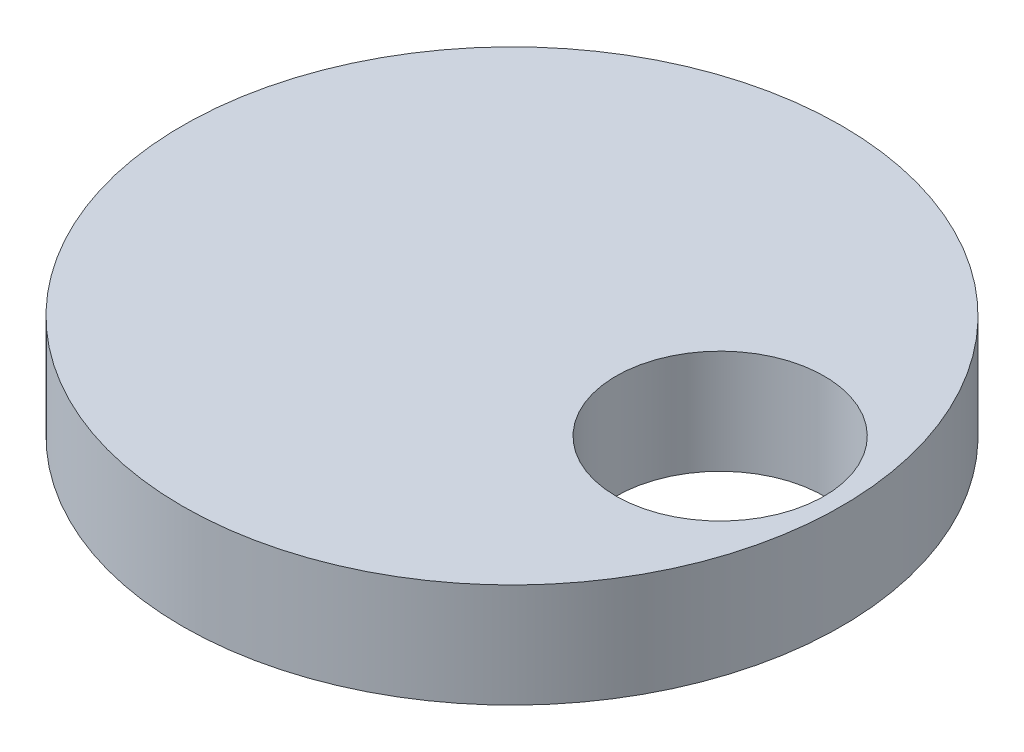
ISO-10303-21;
HEADER;
FILE_DESCRIPTION(('STEP AP214'),'2;1');
FILE_NAME('part.step','',(''),(''),'','','');
FILE_SCHEMA(('AUTOMOTIVE_DESIGN { 1 0 10303 214 1 1 1 1 }'));
ENDSEC;
DATA;
#1=APPLICATION_CONTEXT('core data for automotive mechanical design processes');
#2=APPLICATION_PROTOCOL_DEFINITION('international standard','automotive_design',2000,#1);
#3=PRODUCT_CONTEXT('',#1,'mechanical');
#4=PRODUCT('Part','Part','',(#3));
#5=PRODUCT_RELATED_PRODUCT_CATEGORY('part','',(#4));
#6=PRODUCT_DEFINITION_FORMATION('','',#4);
#7=PRODUCT_DEFINITION_CONTEXT('part definition',#1,'design');
#8=PRODUCT_DEFINITION('design','',#6,#7);
#9=PRODUCT_DEFINITION_SHAPE('','',#8);
#10=(LENGTH_UNIT() NAMED_UNIT(*) SI_UNIT(.MILLI.,.METRE.));
#11=(NAMED_UNIT(*) PLANE_ANGLE_UNIT() SI_UNIT($,.RADIAN.));
#12=(NAMED_UNIT(*) SI_UNIT($,.STERADIAN.) SOLID_ANGLE_UNIT());
#13=UNCERTAINTY_MEASURE_WITH_UNIT(LENGTH_MEASURE(1.E-05),#10,'distance_accuracy_value','');
#14=(GEOMETRIC_REPRESENTATION_CONTEXT(3) GLOBAL_UNCERTAINTY_ASSIGNED_CONTEXT((#13)) GLOBAL_UNIT_ASSIGNED_CONTEXT((#10,
#11,#12)) REPRESENTATION_CONTEXT('',''));
#15=CARTESIAN_POINT('',(0.,0.,0.));
#16=DIRECTION('',(0.,0.,1.));
#17=DIRECTION('',(1.,0.,0.));
#18=AXIS2_PLACEMENT_3D('',#15,#16,#17);
#19=CARTESIAN_POINT('',(0.,3.,0.));
#20=DIRECTION('',(0.,1.,0.));
#21=DIRECTION('',(0.,0.,1.));
#22=AXIS2_PLACEMENT_3D('',#19,#20,#21);
#23=PLANE('',#22);
#24=CARTESIAN_POINT('',(0.,3.,0.));
#25=DIRECTION('',(0.,1.,0.));
#26=DIRECTION('',(0.,0.,1.));
#27=AXIS2_PLACEMENT_3D('',#24,#25,#26);
#28=CIRCLE('',#27,9.5);
#29=CARTESIAN_POINT('',(0.,3.,9.5));
#30=VERTEX_POINT('',#29);
#31=EDGE_CURVE('E10',#30,#30,#28,.T.);
#32=ORIENTED_EDGE('',*,*,#31,.T.);
#33=EDGE_LOOP('',(#32));
#34=FACE_BOUND('',#33,.T.);
#35=CARTESIAN_POINT('',(6.,3.,0.));
#36=DIRECTION('',(0.,1.,0.));
#37=DIRECTION('',(0.,0.,1.));
#38=AXIS2_PLACEMENT_3D('',#35,#36,#37);
#39=CIRCLE('',#38,3.);
#40=CARTESIAN_POINT('',(6.,3.,3.));
#41=VERTEX_POINT('',#40);
#42=EDGE_CURVE('E43',#41,#41,#39,.T.);
#43=ORIENTED_EDGE('',*,*,#42,.F.);
#44=EDGE_LOOP('',(#43));
#45=FACE_BOUND('',#44,.T.);
#46=ADVANCED_FACE('F32',(#34,#45),#23,.T.);
#47=CARTESIAN_POINT('',(0.,0.,0.));
#48=DIRECTION('',(0.,1.,0.));
#49=DIRECTION('',(0.,0.,1.));
#50=AXIS2_PLACEMENT_3D('',#47,#48,#49);
#51=PLANE('',#50);
#52=CARTESIAN_POINT('',(0.,0.,0.));
#53=DIRECTION('',(0.,1.,0.));
#54=DIRECTION('',(0.,0.,1.));
#55=AXIS2_PLACEMENT_3D('',#52,#53,#54);
#56=CIRCLE('',#55,9.5);
#57=CARTESIAN_POINT('',(0.,0.,9.5));
#58=VERTEX_POINT('',#57);
#59=EDGE_CURVE('E39',#58,#58,#56,.T.);
#60=ORIENTED_EDGE('',*,*,#59,.F.);
#61=EDGE_LOOP('',(#60));
#62=FACE_BOUND('',#61,.T.);
#63=CARTESIAN_POINT('',(6.,0.,0.));
#64=DIRECTION('',(0.,1.,0.));
#65=DIRECTION('',(0.,0.,1.));
#66=AXIS2_PLACEMENT_3D('',#63,#64,#65);
#67=CIRCLE('',#66,3.);
#68=CARTESIAN_POINT('',(6.,0.,3.));
#69=VERTEX_POINT('',#68);
#70=EDGE_CURVE('E47',#69,#69,#67,.T.);
#71=ORIENTED_EDGE('',*,*,#70,.T.);
#72=EDGE_LOOP('',(#71));
#73=FACE_BOUND('',#72,.T.);
#74=ADVANCED_FACE('F53',(#62,#73),#51,.F.);
#75=CARTESIAN_POINT('',(0.,3.,0.));
#76=DIRECTION('',(0.,-1.,0.));
#77=DIRECTION('',(0.,0.,-1.));
#78=AXIS2_PLACEMENT_3D('',#75,#76,#77);
#79=CYLINDRICAL_SURFACE('',#78,9.5);
#80=ORIENTED_EDGE('',*,*,#31,.F.);
#81=EDGE_LOOP('',(#80));
#82=FACE_BOUND('',#81,.T.);
#83=ORIENTED_EDGE('',*,*,#59,.T.);
#84=EDGE_LOOP('',(#83));
#85=FACE_BOUND('',#84,.T.);
#86=ADVANCED_FACE('F34',(#82,#85),#79,.T.);
#87=CARTESIAN_POINT('',(6.,3.,0.));
#88=DIRECTION('',(0.,-1.,0.));
#89=DIRECTION('',(0.,0.,-1.));
#90=AXIS2_PLACEMENT_3D('',#87,#88,#89);
#91=CYLINDRICAL_SURFACE('',#90,3.);
#92=ORIENTED_EDGE('',*,*,#42,.T.);
#93=EDGE_LOOP('',(#92));
#94=FACE_BOUND('',#93,.T.);
#95=ORIENTED_EDGE('',*,*,#70,.F.);
#96=EDGE_LOOP('',(#95));
#97=FACE_BOUND('',#96,.T.);
#98=ADVANCED_FACE('F55',(#94,#97),#91,.F.);
#99=CLOSED_SHELL('',(#46,#74,#86,#98));
#100=MANIFOLD_SOLID_BREP('B2',#99);
#101=ADVANCED_BREP_SHAPE_REPRESENTATION('',(#18,#100),#14);
#102=SHAPE_DEFINITION_REPRESENTATION(#9,#101);
ENDSEC;
END-ISO-10303-21;
